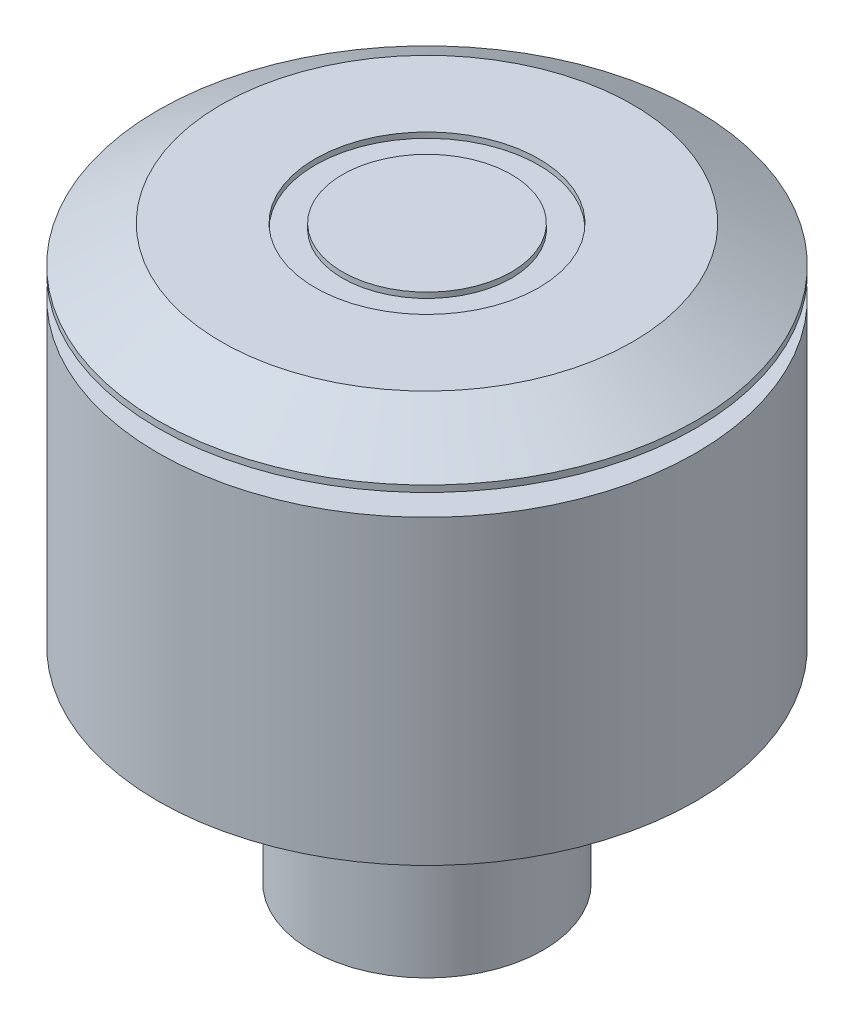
ISO-10303-21;
HEADER;
FILE_DESCRIPTION(('STEP AP214'),'2;1');
FILE_NAME('part.step','',(''),(''),'','','');
FILE_SCHEMA(('AUTOMOTIVE_DESIGN { 1 0 10303 214 1 1 1 1 }'));
ENDSEC;
DATA;
#1=APPLICATION_CONTEXT('core data for automotive mechanical design processes');
#2=APPLICATION_PROTOCOL_DEFINITION('international standard','automotive_design',2000,#1);
#3=PRODUCT_CONTEXT('',#1,'mechanical');
#4=PRODUCT('Part','Part','',(#3));
#5=PRODUCT_RELATED_PRODUCT_CATEGORY('part','',(#4));
#6=PRODUCT_DEFINITION_FORMATION('','',#4);
#7=PRODUCT_DEFINITION_CONTEXT('part definition',#1,'design');
#8=PRODUCT_DEFINITION('design','',#6,#7);
#9=PRODUCT_DEFINITION_SHAPE('','',#8);
#10=(LENGTH_UNIT() NAMED_UNIT(*) SI_UNIT(.MILLI.,.METRE.));
#11=(NAMED_UNIT(*) PLANE_ANGLE_UNIT() SI_UNIT($,.RADIAN.));
#12=(NAMED_UNIT(*) SI_UNIT($,.STERADIAN.) SOLID_ANGLE_UNIT());
#13=UNCERTAINTY_MEASURE_WITH_UNIT(LENGTH_MEASURE(1.E-05),#10,'distance_accuracy_value','');
#14=(GEOMETRIC_REPRESENTATION_CONTEXT(3) GLOBAL_UNCERTAINTY_ASSIGNED_CONTEXT((#13)) GLOBAL_UNIT_ASSIGNED_CONTEXT((#10,
#11,#12)) REPRESENTATION_CONTEXT('',''));
#15=CARTESIAN_POINT('',(0.,0.,0.));
#16=DIRECTION('',(0.,0.,1.));
#17=DIRECTION('',(1.,0.,0.));
#18=AXIS2_PLACEMENT_3D('',#15,#16,#17);
#19=CARTESIAN_POINT('',(0.,0.,0.));
#20=DIRECTION('',(0.,-1.,0.));
#21=DIRECTION('',(1.,0.,0.));
#22=AXIS2_PLACEMENT_3D('',#19,#20,#21);
#23=PLANE('',#22);
#24=CARTESIAN_POINT('',(0.,0.,0.));
#25=DIRECTION('',(0.,-1.,0.));
#26=DIRECTION('',(1.,0.,0.));
#27=AXIS2_PLACEMENT_3D('',#24,#25,#26);
#28=CIRCLE('',#27,5.3975);
#29=CARTESIAN_POINT('',(5.3975,0.,0.));
#30=VERTEX_POINT('',#29);
#31=EDGE_CURVE('E10',#30,#30,#28,.T.);
#32=ORIENTED_EDGE('',*,*,#31,.T.);
#33=EDGE_LOOP('',(#32));
#34=FACE_BOUND('',#33,.T.);
#35=ADVANCED_FACE('F32',(#34),#23,.T.);
#36=CARTESIAN_POINT('',(3.49148133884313E-12,-1000.,0.));
#37=DIRECTION('',(0.,-1.,0.));
#38=DIRECTION('',(1.,0.,0.));
#39=AXIS2_PLACEMENT_3D('',#36,#37,#38);
#40=CYLINDRICAL_SURFACE('',#39,5.39750000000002);
#41=CARTESIAN_POINT('',(0.,9.55039999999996,0.));
#42=DIRECTION('',(0.,-1.,0.));
#43=DIRECTION('',(1.,0.,0.));
#44=AXIS2_PLACEMENT_3D('',#41,#42,#43);
#45=CIRCLE('',#44,5.39750000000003);
#46=CARTESIAN_POINT('',(5.3975,9.55039999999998,0.));
#47=VERTEX_POINT('',#46);
#48=EDGE_CURVE('E38',#47,#47,#45,.T.);
#49=ORIENTED_EDGE('',*,*,#48,.T.);
#50=EDGE_LOOP('',(#49));
#51=FACE_BOUND('',#50,.T.);
#52=ORIENTED_EDGE('',*,*,#31,.F.);
#53=EDGE_LOOP('',(#52));
#54=FACE_BOUND('',#53,.T.);
#55=ADVANCED_FACE('F91',(#51,#54),#40,.T.);
#56=CARTESIAN_POINT('',(-5.39750000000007,9.55039999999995,0.));
#57=DIRECTION('',(0.,-1.,0.));
#58=DIRECTION('',(1.,0.,0.));
#59=AXIS2_PLACEMENT_3D('',#56,#57,#58);
#60=PLANE('',#59);
#61=CARTESIAN_POINT('',(0.,9.55039999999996,0.));
#62=DIRECTION('',(0.,-1.,0.));
#63=DIRECTION('',(1.,0.,0.));
#64=AXIS2_PLACEMENT_3D('',#61,#62,#63);
#65=CIRCLE('',#64,12.5);
#66=CARTESIAN_POINT('',(12.5,9.5504,0.));
#67=VERTEX_POINT('',#66);
#68=EDGE_CURVE('E42',#67,#67,#65,.T.);
#69=ORIENTED_EDGE('',*,*,#68,.T.);
#70=EDGE_LOOP('',(#69));
#71=FACE_BOUND('',#70,.T.);
#72=ORIENTED_EDGE('',*,*,#48,.F.);
#73=EDGE_LOOP('',(#72));
#74=FACE_BOUND('',#73,.T.);
#75=ADVANCED_FACE('F95',(#71,#74),#60,.T.);
#76=CARTESIAN_POINT('',(3.49148133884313E-12,-1000.,0.));
#77=DIRECTION('',(0.,-1.,0.));
#78=DIRECTION('',(1.,0.,0.));
#79=AXIS2_PLACEMENT_3D('',#76,#77,#78);
#80=CYLINDRICAL_SURFACE('',#79,12.5000000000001);
#81=CARTESIAN_POINT('',(0.,23.5618,0.));
#82=DIRECTION('',(0.,-1.,0.));
#83=DIRECTION('',(1.,0.,0.));
#84=AXIS2_PLACEMENT_3D('',#81,#82,#83);
#85=CIRCLE('',#84,12.5000000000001);
#86=CARTESIAN_POINT('',(12.5,23.5618,0.));
#87=VERTEX_POINT('',#86);
#88=EDGE_CURVE('E46',#87,#87,#85,.T.);
#89=ORIENTED_EDGE('',*,*,#88,.T.);
#90=EDGE_LOOP('',(#89));
#91=FACE_BOUND('',#90,.T.);
#92=ORIENTED_EDGE('',*,*,#68,.F.);
#93=EDGE_LOOP('',(#92));
#94=FACE_BOUND('',#93,.T.);
#95=ADVANCED_FACE('F99',(#91,#94),#80,.T.);
#96=CARTESIAN_POINT('',(-11.0000000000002,23.5617999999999,0.));
#97=DIRECTION('',(0.,1.,0.));
#98=DIRECTION('',(-1.,0.,0.));
#99=AXIS2_PLACEMENT_3D('',#96,#97,#98);
#100=PLANE('',#99);
#101=CARTESIAN_POINT('',(0.,23.5618,0.));
#102=DIRECTION('',(0.,-1.,0.));
#103=DIRECTION('',(1.,0.,0.));
#104=AXIS2_PLACEMENT_3D('',#101,#102,#103);
#105=CIRCLE('',#104,11.0000000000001);
#106=CARTESIAN_POINT('',(11.,23.5618,0.));
#107=VERTEX_POINT('',#106);
#108=EDGE_CURVE('E51',#107,#107,#105,.T.);
#109=ORIENTED_EDGE('',*,*,#108,.T.);
#110=EDGE_LOOP('',(#109));
#111=FACE_BOUND('',#110,.T.);
#112=ORIENTED_EDGE('',*,*,#88,.F.);
#113=EDGE_LOOP('',(#112));
#114=FACE_BOUND('',#113,.T.);
#115=ADVANCED_FACE('F106',(#111,#114),#100,.T.);
#116=CARTESIAN_POINT('',(3.49148133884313E-12,-1000.,0.));
#117=DIRECTION('',(0.,-1.,0.));
#118=DIRECTION('',(1.,0.,0.));
#119=AXIS2_PLACEMENT_3D('',#116,#117,#118);
#120=CYLINDRICAL_SURFACE('',#119,11.0000000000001);
#121=CARTESIAN_POINT('',(0.,24.5617999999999,0.));
#122=DIRECTION('',(0.,-1.,0.));
#123=DIRECTION('',(1.,0.,0.));
#124=AXIS2_PLACEMENT_3D('',#121,#122,#123);
#125=CIRCLE('',#124,11.0000000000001);
#126=CARTESIAN_POINT('',(11.,24.5617999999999,0.));
#127=VERTEX_POINT('',#126);
#128=EDGE_CURVE('E54',#127,#127,#125,.T.);
#129=ORIENTED_EDGE('',*,*,#128,.T.);
#130=EDGE_LOOP('',(#129));
#131=FACE_BOUND('',#130,.T.);
#132=ORIENTED_EDGE('',*,*,#108,.F.);
#133=EDGE_LOOP('',(#132));
#134=FACE_BOUND('',#133,.T.);
#135=ADVANCED_FACE('F110',(#131,#134),#120,.T.);
#136=CARTESIAN_POINT('',(-11.0000000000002,24.5617999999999,0.));
#137=DIRECTION('',(0.,-1.,0.));
#138=DIRECTION('',(1.,0.,0.));
#139=AXIS2_PLACEMENT_3D('',#136,#137,#138);
#140=PLANE('',#139);
#141=CARTESIAN_POINT('',(0.,24.5617999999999,0.));
#142=DIRECTION('',(0.,-1.,0.));
#143=DIRECTION('',(1.,0.,0.));
#144=AXIS2_PLACEMENT_3D('',#141,#142,#143);
#145=CIRCLE('',#144,12.5000000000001);
#146=CARTESIAN_POINT('',(12.5,24.5617999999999,0.));
#147=VERTEX_POINT('',#146);
#148=EDGE_CURVE('E57',#147,#147,#145,.T.);
#149=ORIENTED_EDGE('',*,*,#148,.T.);
#150=EDGE_LOOP('',(#149));
#151=FACE_BOUND('',#150,.T.);
#152=ORIENTED_EDGE('',*,*,#128,.F.);
#153=EDGE_LOOP('',(#152));
#154=FACE_BOUND('',#153,.T.);
#155=ADVANCED_FACE('F114',(#151,#154),#140,.T.);
#156=CARTESIAN_POINT('',(3.49148133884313E-12,-1000.,0.));
#157=DIRECTION('',(0.,-1.,0.));
#158=DIRECTION('',(1.,0.,0.));
#159=AXIS2_PLACEMENT_3D('',#156,#157,#158);
#160=CYLINDRICAL_SURFACE('',#159,12.5000000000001);
#161=CARTESIAN_POINT('',(0.,24.8617999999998,0.));
#162=DIRECTION('',(0.,-1.,0.));
#163=DIRECTION('',(1.,0.,0.));
#164=AXIS2_PLACEMENT_3D('',#161,#162,#163);
#165=CIRCLE('',#164,12.5000000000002);
#166=CARTESIAN_POINT('',(12.5000000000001,24.8617999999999,0.));
#167=VERTEX_POINT('',#166);
#168=EDGE_CURVE('E60',#167,#167,#165,.T.);
#169=ORIENTED_EDGE('',*,*,#168,.T.);
#170=EDGE_LOOP('',(#169));
#171=FACE_BOUND('',#170,.T.);
#172=ORIENTED_EDGE('',*,*,#148,.F.);
#173=EDGE_LOOP('',(#172));
#174=FACE_BOUND('',#173,.T.);
#175=ADVANCED_FACE('F118',(#171,#174),#160,.T.);
#176=CARTESIAN_POINT('',(0.,24.8617999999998,0.));
#177=DIRECTION('',(0.,-1.,0.));
#178=DIRECTION('',(1.,0.,0.));
#179=AXIS2_PLACEMENT_3D('',#176,#177,#178);
#180=CONICAL_SURFACE('',#179,12.5000000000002,1.04719755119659);
#181=CARTESIAN_POINT('',(0.,26.5617999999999,0.));
#182=DIRECTION('',(0.,-1.,0.));
#183=DIRECTION('',(1.,0.,0.));
#184=AXIS2_PLACEMENT_3D('',#181,#182,#183);
#185=CIRCLE('',#184,9.55551362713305);
#186=CARTESIAN_POINT('',(9.55551362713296,26.5617999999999,0.));
#187=VERTEX_POINT('',#186);
#188=EDGE_CURVE('E63',#187,#187,#185,.T.);
#189=ORIENTED_EDGE('',*,*,#188,.T.);
#190=EDGE_LOOP('',(#189));
#191=FACE_BOUND('',#190,.T.);
#192=ORIENTED_EDGE('',*,*,#168,.F.);
#193=EDGE_LOOP('',(#192));
#194=FACE_BOUND('',#193,.T.);
#195=ADVANCED_FACE('F122',(#191,#194),#180,.T.);
#196=CARTESIAN_POINT('',(-9.55551362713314,26.5617999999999,0.));
#197=DIRECTION('',(0.,1.,0.));
#198=DIRECTION('',(-1.,0.,0.));
#199=AXIS2_PLACEMENT_3D('',#196,#197,#198);
#200=PLANE('',#199);
#201=CARTESIAN_POINT('',(0.,26.5617999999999,0.));
#202=DIRECTION('',(0.,-1.,0.));
#203=DIRECTION('',(1.,0.,0.));
#204=AXIS2_PLACEMENT_3D('',#201,#202,#203);
#205=CIRCLE('',#204,5.19430000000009);
#206=CARTESIAN_POINT('',(5.1943,26.5617999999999,0.));
#207=VERTEX_POINT('',#206);
#208=EDGE_CURVE('E66',#207,#207,#205,.T.);
#209=ORIENTED_EDGE('',*,*,#208,.T.);
#210=EDGE_LOOP('',(#209));
#211=FACE_BOUND('',#210,.T.);
#212=ORIENTED_EDGE('',*,*,#188,.F.);
#213=EDGE_LOOP('',(#212));
#214=FACE_BOUND('',#213,.T.);
#215=ADVANCED_FACE('F126',(#211,#214),#200,.T.);
#216=CARTESIAN_POINT('',(3.49148133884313E-12,-1000.,0.));
#217=DIRECTION('',(0.,-1.,0.));
#218=DIRECTION('',(1.,0.,0.));
#219=AXIS2_PLACEMENT_3D('',#216,#217,#218);
#220=CYLINDRICAL_SURFACE('',#219,5.19430000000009);
#221=CARTESIAN_POINT('',(0.,26.3077999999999,0.));
#222=DIRECTION('',(0.,-1.,0.));
#223=DIRECTION('',(1.,0.,0.));
#224=AXIS2_PLACEMENT_3D('',#221,#222,#223);
#225=CIRCLE('',#224,5.19430000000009);
#226=CARTESIAN_POINT('',(5.1943,26.3077999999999,0.));
#227=VERTEX_POINT('',#226);
#228=EDGE_CURVE('E69',#227,#227,#225,.T.);
#229=ORIENTED_EDGE('',*,*,#228,.T.);
#230=EDGE_LOOP('',(#229));
#231=FACE_BOUND('',#230,.T.);
#232=ORIENTED_EDGE('',*,*,#208,.F.);
#233=EDGE_LOOP('',(#232));
#234=FACE_BOUND('',#233,.T.);
#235=ADVANCED_FACE('F130',(#231,#234),#220,.F.);
#236=CARTESIAN_POINT('',(-5.19430000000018,26.3078,0.));
#237=DIRECTION('',(0.,1.,0.));
#238=DIRECTION('',(-1.,0.,0.));
#239=AXIS2_PLACEMENT_3D('',#236,#237,#238);
#240=PLANE('',#239);
#241=CARTESIAN_POINT('',(0.,26.3077999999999,0.));
#242=DIRECTION('',(0.,-1.,0.));
#243=DIRECTION('',(1.,0.,0.));
#244=AXIS2_PLACEMENT_3D('',#241,#242,#243);
#245=CIRCLE('',#244,3.92430000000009);
#246=CARTESIAN_POINT('',(3.9243,26.3077999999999,0.));
#247=VERTEX_POINT('',#246);
#248=EDGE_CURVE('E72',#247,#247,#245,.T.);
#249=ORIENTED_EDGE('',*,*,#248,.T.);
#250=EDGE_LOOP('',(#249));
#251=FACE_BOUND('',#250,.T.);
#252=ORIENTED_EDGE('',*,*,#228,.F.);
#253=EDGE_LOOP('',(#252));
#254=FACE_BOUND('',#253,.T.);
#255=ADVANCED_FACE('F88',(#251,#254),#240,.T.);
#256=CARTESIAN_POINT('',(3.49148133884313E-12,-1000.,0.));
#257=DIRECTION('',(0.,-1.,0.));
#258=DIRECTION('',(1.,0.,0.));
#259=AXIS2_PLACEMENT_3D('',#256,#257,#258);
#260=CYLINDRICAL_SURFACE('',#259,3.92430000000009);
#261=CARTESIAN_POINT('',(0.,26.5618000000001,0.));
#262=DIRECTION('',(0.,-1.,0.));
#263=DIRECTION('',(1.,0.,0.));
#264=AXIS2_PLACEMENT_3D('',#261,#262,#263);
#265=CIRCLE('',#264,3.92430000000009);
#266=CARTESIAN_POINT('',(3.9243,26.5618000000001,0.));
#267=VERTEX_POINT('',#266);
#268=EDGE_CURVE('E75',#267,#267,#265,.T.);
#269=ORIENTED_EDGE('',*,*,#268,.T.);
#270=EDGE_LOOP('',(#269));
#271=FACE_BOUND('',#270,.T.);
#272=ORIENTED_EDGE('',*,*,#248,.F.);
#273=EDGE_LOOP('',(#272));
#274=FACE_BOUND('',#273,.T.);
#275=ADVANCED_FACE('F79',(#271,#274),#260,.T.);
#276=CARTESIAN_POINT('',(-3.92430000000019,26.5618,0.));
#277=DIRECTION('',(0.,1.,0.));
#278=DIRECTION('',(-1.,0.,0.));
#279=AXIS2_PLACEMENT_3D('',#276,#277,#278);
#280=PLANE('',#279);
#281=ORIENTED_EDGE('',*,*,#268,.F.);
#282=EDGE_LOOP('',(#281));
#283=FACE_BOUND('',#282,.T.);
#284=ADVANCED_FACE('F82',(#283),#280,.T.);
#285=CLOSED_SHELL('',(#35,#55,#75,#95,#115,#135,#155,#175,#195,#215,#235,#255,#275,#284));
#286=MANIFOLD_SOLID_BREP('B2',#285);
#287=ADVANCED_BREP_SHAPE_REPRESENTATION('',(#18,#286),#14);
#288=SHAPE_DEFINITION_REPRESENTATION(#9,#287);
ENDSEC;
END-ISO-10303-21;
